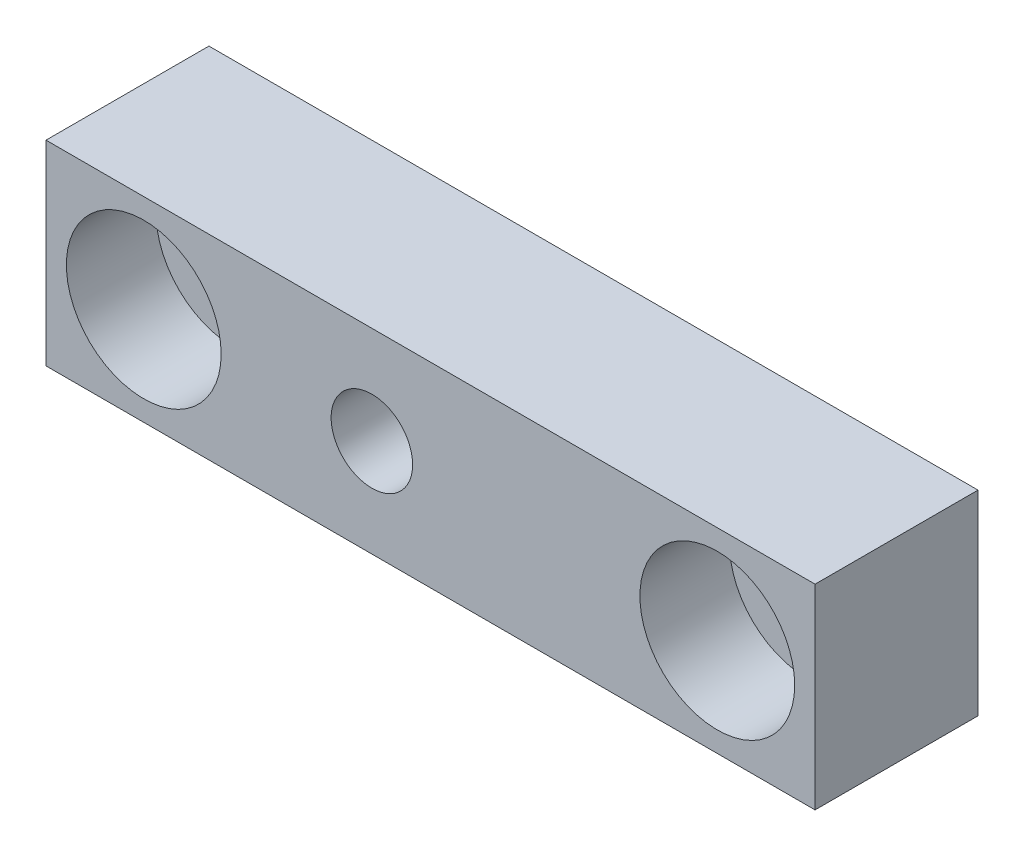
from build123d import *

# Parameters (mm, degrees)
SKETCH_1_W          = 47.2
SKETCH_1_H          = 12
SKETCH_1_R          = 2.75
SKETCH_1_R_2        = 2.5
EXTRUDE_1_DEPTH     = 10
SKETCH_2_R          = 4.75
CUT_EXTRUDE_1_DEPTH = 5.5


with BuildPart() as part:
    # Sketch 1 → Extrude 1 (new body)
    with BuildSketch(Plane.XY):
        with Locations((23.6, 6)):
            Rectangle(SKETCH_1_W, SKETCH_1_H)
        with Locations((41.2, 6)):
            Circle(SKETCH_1_R, mode=Mode.SUBTRACT)
        with Locations((6, 6)):
            Circle(SKETCH_1_R, mode=Mode.SUBTRACT)
        with Locations((20, 6)):
            Circle(SKETCH_1_R_2, mode=Mode.SUBTRACT)
    extrude(amount=EXTRUDE_1_DEPTH)

    # Sketch 2 → Cut-Extrude 1 (cut)
    with BuildSketch(Plane.XY.offset(10)):
        with Locations((41.2, 6)):
            Circle(SKETCH_2_R)
        with Locations((6, 6)):
            Circle(SKETCH_2_R)
    extrude(amount=-CUT_EXTRUDE_1_DEPTH, mode=Mode.SUBTRACT)


solid = part.part
